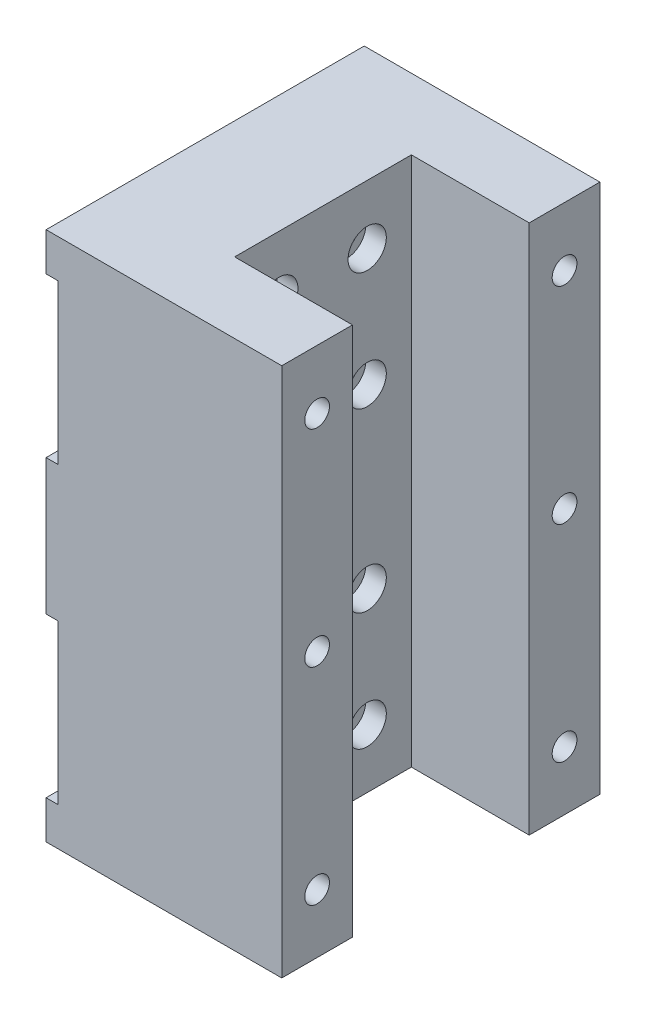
from build123d import *

# Parameters (mm, degrees)
EXTRUDE_1_DEPTH     = 54
SKETCH_2_W          = 26.236943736
SKETCH_2_H          = 30
CUT_EXTRUDE_1_DEPTH = 113.320968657
SKETCH_3_R          = 2.5
CUT_EXTRUDE_2_DEPTH = 25
SKETCH_4_R          = 2.1
CUT_EXTRUDE_3_DEPTH = 25
SKETCH_5_R          = 1.75
CUT_EXTRUDE_4_DEPTH = 25
SKETCH_6_R          = 3.25
CUT_EXTRUDE_5_DEPTH = 3.5


with BuildPart() as part:
    # Sketch 1 → Extrude 1 (new body)
    with BuildSketch(Plane.XY):
        Polygon((0, 90), (40, 90), (40, 0), (0, 0), (0, 6.5), (2, 6.5), (2, 33.5), (0, 33.5), (0, 56.5), (2, 56.5), (2, 83.5), (0, 83.5), align=None)
    extrude(amount=EXTRUDE_1_DEPTH)

    # Sketch 2 → Cut-Extrude 1 (cut, through all)
    with BuildSketch(Plane(origin=(0, 90, 0), x_dir=(1, 0, 0), z_dir=(0, 1, 0))):
        with Locations((33.118471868, -27)):
            Rectangle(SKETCH_2_W, SKETCH_2_H)
    extrude(amount=-CUT_EXTRUDE_1_DEPTH, mode=Mode.SUBTRACT)

    # Sketch 3 → Cut-Extrude 2 (cut)
    with BuildSketch(Plane.XZ):
        with Locations(Location((25, 48, 0), (0, 0, 270))):
            Circle(SKETCH_3_R)
        with Locations(Location((25, 6, 0), (0, 0, 270))):
            Circle(SKETCH_3_R)
        with Locations(Location((10, 48, 0), (0, 0, 270))):
            Circle(SKETCH_3_R)
        with Locations(Location((10, 6, 0), (0, 0, 270))):
            Circle(SKETCH_3_R)
    extrude(amount=-CUT_EXTRUDE_2_DEPTH, mode=Mode.SUBTRACT)

    # Sketch 4 → Cut-Extrude 3 (cut)
    with BuildSketch(Plane(origin=(40, 0, 0), x_dir=(0, 0, -1), z_dir=(1, 0, 0))):
        with Locations((-48, 80)):
            Circle(SKETCH_4_R)
        with Locations((-6, 80)):
            Circle(SKETCH_4_R)
        with Locations((-48, 45)):
            Circle(SKETCH_4_R)
        with Locations((-6, 45)):
            Circle(SKETCH_4_R)
        with Locations((-6, 10)):
            Circle(SKETCH_4_R)
        with Locations((-48, 10)):
            Circle(SKETCH_4_R)
    extrude(amount=-CUT_EXTRUDE_3_DEPTH, mode=Mode.SUBTRACT)

    # Sketch 5 → Cut-Extrude 4 (cut)
    with BuildSketch(Plane(origin=(20, 0, 0), x_dir=(0, 0, -1), z_dir=(1, 0, 0))):
        with Locations((-34.5, 30)):
            Circle(SKETCH_5_R)
        with Locations((-19.5, 30)):
            Circle(SKETCH_5_R)
        with Locations((-34.5, 10)):
            Circle(SKETCH_5_R)
        with Locations((-19.5, 10)):
            Circle(SKETCH_5_R)
        with Locations((-34.5, 60)):
            Circle(SKETCH_5_R)
        with Locations((-19.5, 60)):
            Circle(SKETCH_5_R)
        with Locations((-19.5, 80)):
            Circle(SKETCH_5_R)
        with Locations((-34.5, 80)):
            Circle(SKETCH_5_R)
    extrude(amount=-CUT_EXTRUDE_4_DEPTH, mode=Mode.SUBTRACT)

    # Sketch 6 → Cut-Extrude 5 (cut)
    with BuildSketch(Plane(origin=(20, 0, 0), x_dir=(0, 0, -1), z_dir=(1, 0, 0))):
        with Locations((-34.5, 30)):
            Circle(SKETCH_6_R)
        with Locations((-19.5, 30)):
            Circle(SKETCH_6_R)
        with Locations((-34.5, 10)):
            Circle(SKETCH_6_R)
        with Locations((-19.5, 10)):
            Circle(SKETCH_6_R)
        with Locations((-34.5, 60)):
            Circle(SKETCH_6_R)
        with Locations((-19.5, 60)):
            Circle(SKETCH_6_R)
        with Locations((-19.5, 80)):
            Circle(SKETCH_6_R)
        with Locations((-34.5, 80)):
            Circle(SKETCH_6_R)
    extrude(amount=-CUT_EXTRUDE_5_DEPTH, mode=Mode.SUBTRACT)


solid = part.part
